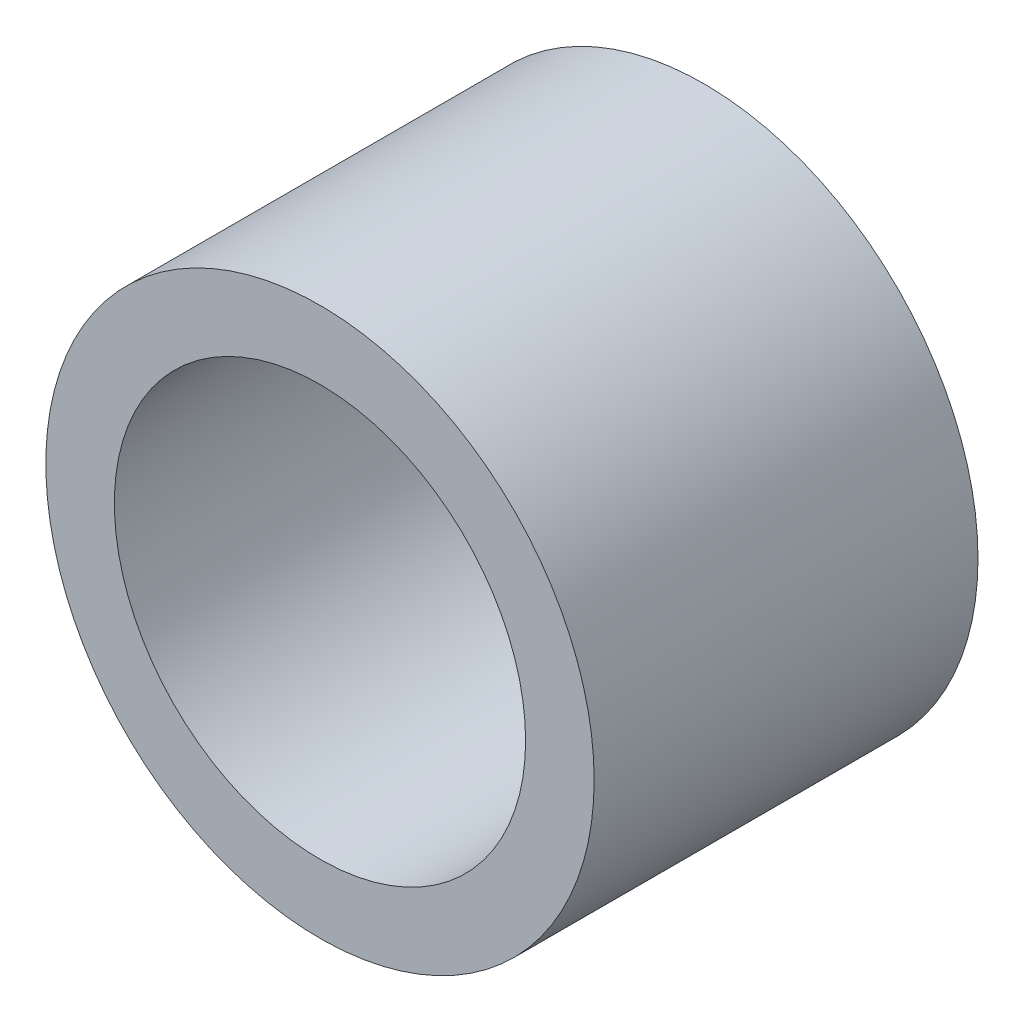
from build123d import *

# Parameters (mm, degrees)
SKETCH1_R      = 6.35
SKETCH1_R_2    = 4.7625
EXTRUDE1_DEPTH = 8.89


with BuildPart() as part:
    # Sketch1 → Extrude1 (new body)
    with BuildSketch(Plane.XY):
        with Locations((-38.1, 0)):
            Circle(SKETCH1_R)
        with Locations((-38.1, 0)):
            Circle(SKETCH1_R_2, mode=Mode.SUBTRACT)
    extrude(amount=-EXTRUDE1_DEPTH)


solid = part.part
